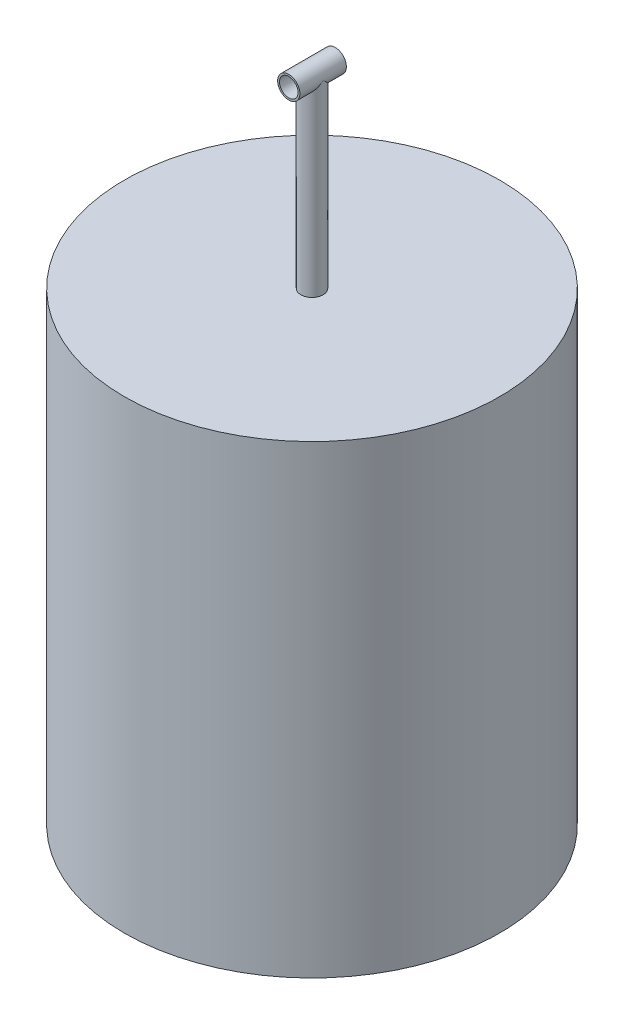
ISO-10303-21;
HEADER;
FILE_DESCRIPTION(('STEP AP214'),'2;1');
FILE_NAME('part.step','',(''),(''),'','','');
FILE_SCHEMA(('AUTOMOTIVE_DESIGN { 1 0 10303 214 1 1 1 1 }'));
ENDSEC;
DATA;
#1=APPLICATION_CONTEXT('core data for automotive mechanical design processes');
#2=APPLICATION_PROTOCOL_DEFINITION('international standard','automotive_design',2000,#1);
#3=PRODUCT_CONTEXT('',#1,'mechanical');
#4=PRODUCT('Part','Part','',(#3));
#5=PRODUCT_RELATED_PRODUCT_CATEGORY('part','',(#4));
#6=PRODUCT_DEFINITION_FORMATION('','',#4);
#7=PRODUCT_DEFINITION_CONTEXT('part definition',#1,'design');
#8=PRODUCT_DEFINITION('design','',#6,#7);
#9=PRODUCT_DEFINITION_SHAPE('','',#8);
#10=(LENGTH_UNIT() NAMED_UNIT(*) SI_UNIT(.MILLI.,.METRE.));
#11=(NAMED_UNIT(*) PLANE_ANGLE_UNIT() SI_UNIT($,.RADIAN.));
#12=(NAMED_UNIT(*) SI_UNIT($,.STERADIAN.) SOLID_ANGLE_UNIT());
#13=UNCERTAINTY_MEASURE_WITH_UNIT(LENGTH_MEASURE(1.E-05),#10,'distance_accuracy_value','');
#14=(GEOMETRIC_REPRESENTATION_CONTEXT(3) GLOBAL_UNCERTAINTY_ASSIGNED_CONTEXT((#13)) GLOBAL_UNIT_ASSIGNED_CONTEXT((#10,
#11,#12)) REPRESENTATION_CONTEXT('',''));
#15=CARTESIAN_POINT('',(0.,0.,0.));
#16=DIRECTION('',(0.,0.,1.));
#17=DIRECTION('',(1.,0.,0.));
#18=AXIS2_PLACEMENT_3D('',#15,#16,#17);
#19=CARTESIAN_POINT('',(0.,200.,25.));
#20=DIRECTION('',(0.,0.,1.));
#21=DIRECTION('',(1.,0.,0.));
#22=AXIS2_PLACEMENT_3D('',#19,#20,#21);
#23=PLANE('',#22);
#24=CARTESIAN_POINT('',(0.,200.,25.));
#25=DIRECTION('',(0.,0.,1.));
#26=DIRECTION('',(1.,0.,0.));
#27=AXIS2_PLACEMENT_3D('',#24,#25,#26);
#28=CIRCLE('',#27,12.);
#29=CARTESIAN_POINT('',(12.,200.,25.));
#30=VERTEX_POINT('',#29);
#31=EDGE_CURVE('E12',#30,#30,#28,.T.);
#32=ORIENTED_EDGE('',*,*,#31,.T.);
#33=EDGE_LOOP('',(#32));
#34=FACE_BOUND('',#33,.T.);
#35=CARTESIAN_POINT('',(0.,200.,25.));
#36=DIRECTION('',(0.,0.,1.));
#37=DIRECTION('',(1.,0.,0.));
#38=AXIS2_PLACEMENT_3D('',#35,#36,#37);
#39=CIRCLE('',#38,10.);
#40=CARTESIAN_POINT('',(10.,200.,25.));
#41=VERTEX_POINT('',#40);
#42=EDGE_CURVE('E60',#41,#41,#39,.T.);
#43=ORIENTED_EDGE('',*,*,#42,.F.);
#44=EDGE_LOOP('',(#43));
#45=FACE_BOUND('',#44,.T.);
#46=ADVANCED_FACE('F49',(#34,#45),#23,.T.);
#47=CARTESIAN_POINT('',(0.,200.,-25.));
#48=DIRECTION('',(0.,0.,1.));
#49=DIRECTION('',(1.,0.,0.));
#50=AXIS2_PLACEMENT_3D('',#47,#48,#49);
#51=PLANE('',#50);
#52=CARTESIAN_POINT('',(0.,200.,-25.));
#53=DIRECTION('',(0.,0.,1.));
#54=DIRECTION('',(1.,0.,0.));
#55=AXIS2_PLACEMENT_3D('',#52,#53,#54);
#56=CIRCLE('',#55,12.);
#57=CARTESIAN_POINT('',(12.,200.,-25.));
#58=VERTEX_POINT('',#57);
#59=EDGE_CURVE('E56',#58,#58,#56,.T.);
#60=ORIENTED_EDGE('',*,*,#59,.F.);
#61=EDGE_LOOP('',(#60));
#62=FACE_BOUND('',#61,.T.);
#63=CARTESIAN_POINT('',(0.,200.,-25.));
#64=DIRECTION('',(0.,0.,1.));
#65=DIRECTION('',(1.,0.,0.));
#66=AXIS2_PLACEMENT_3D('',#63,#64,#65);
#67=CIRCLE('',#66,10.);
#68=CARTESIAN_POINT('',(10.,200.,-25.));
#69=VERTEX_POINT('',#68);
#70=EDGE_CURVE('E64',#69,#69,#67,.T.);
#71=ORIENTED_EDGE('',*,*,#70,.T.);
#72=EDGE_LOOP('',(#71));
#73=FACE_BOUND('',#72,.T.);
#74=ADVANCED_FACE('F70',(#62,#73),#51,.F.);
#75=CARTESIAN_POINT('',(0.,200.,25.));
#76=DIRECTION('',(0.,0.,-1.));
#77=DIRECTION('',(-1.,0.,0.));
#78=AXIS2_PLACEMENT_3D('',#75,#76,#77);
#79=CYLINDRICAL_SURFACE('',#78,12.);
#80=ORIENTED_EDGE('',*,*,#31,.F.);
#81=EDGE_LOOP('',(#80));
#82=FACE_BOUND('',#81,.T.);
#83=ORIENTED_EDGE('',*,*,#59,.T.);
#84=EDGE_LOOP('',(#83));
#85=FACE_BOUND('',#84,.T.);
#86=ADVANCED_FACE('F51',(#82,#85),#79,.T.);
#87=CARTESIAN_POINT('',(0.,200.,25.));
#88=DIRECTION('',(0.,0.,-1.));
#89=DIRECTION('',(-1.,0.,0.));
#90=AXIS2_PLACEMENT_3D('',#87,#88,#89);
#91=CYLINDRICAL_SURFACE('',#90,10.);
#92=ORIENTED_EDGE('',*,*,#42,.T.);
#93=EDGE_LOOP('',(#92));
#94=FACE_BOUND('',#93,.T.);
#95=ORIENTED_EDGE('',*,*,#70,.F.);
#96=EDGE_LOOP('',(#95));
#97=FACE_BOUND('',#96,.T.);
#98=ADVANCED_FACE('F72',(#94,#97),#91,.F.);
#99=CLOSED_SHELL('',(#46,#74,#86,#98));
#100=MANIFOLD_SOLID_BREP('B2',#99);
#101=CARTESIAN_POINT('',(0.,0.,0.));
#102=DIRECTION('',(0.,1.,0.));
#103=DIRECTION('',(0.,0.,1.));
#104=AXIS2_PLACEMENT_3D('',#101,#102,#103);
#105=PLANE('',#104);
#106=CARTESIAN_POINT('',(0.,0.,0.));
#107=DIRECTION('',(0.,1.,0.));
#108=DIRECTION('',(0.,0.,1.));
#109=AXIS2_PLACEMENT_3D('',#106,#107,#108);
#110=CIRCLE('',#109,201.95);
#111=CARTESIAN_POINT('',(0.,0.,201.95));
#112=VERTEX_POINT('',#111);
#113=EDGE_CURVE('E125',#112,#112,#110,.T.);
#114=ORIENTED_EDGE('',*,*,#113,.T.);
#115=EDGE_LOOP('',(#114));
#116=FACE_BOUND('',#115,.T.);
#117=CARTESIAN_POINT('',(0.,0.,0.));
#118=DIRECTION('',(0.,1.,0.));
#119=DIRECTION('',(-1.,0.,0.));
#120=AXIS2_PLACEMENT_3D('',#117,#118,#119);
#121=CIRCLE('',#120,12.);
#122=CARTESIAN_POINT('',(-12.,0.,0.));
#123=VERTEX_POINT('',#122);
#124=EDGE_CURVE('E165',#123,#123,#121,.T.);
#125=ORIENTED_EDGE('',*,*,#124,.F.);
#126=EDGE_LOOP('',(#125));
#127=FACE_BOUND('',#126,.T.);
#128=ADVANCED_FACE('F103',(#116,#127),#105,.T.);
#129=CARTESIAN_POINT('',(0.,-500.,0.));
#130=DIRECTION('',(0.,1.,0.));
#131=DIRECTION('',(0.,0.,1.));
#132=AXIS2_PLACEMENT_3D('',#129,#130,#131);
#133=CYLINDRICAL_SURFACE('',#132,201.95);
#134=CARTESIAN_POINT('',(0.,-500.,0.));
#135=DIRECTION('',(0.,1.,0.));
#136=DIRECTION('',(0.,0.,1.));
#137=AXIS2_PLACEMENT_3D('',#134,#135,#136);
#138=CIRCLE('',#137,201.95);
#139=CARTESIAN_POINT('',(0.,-500.,201.95));
#140=VERTEX_POINT('',#139);
#141=EDGE_CURVE('E112',#140,#140,#138,.T.);
#142=ORIENTED_EDGE('',*,*,#141,.T.);
#143=EDGE_LOOP('',(#142));
#144=FACE_BOUND('',#143,.T.);
#145=ORIENTED_EDGE('',*,*,#113,.F.);
#146=EDGE_LOOP('',(#145));
#147=FACE_BOUND('',#146,.T.);
#148=ADVANCED_FACE('F105',(#144,#147),#133,.T.);
#149=CARTESIAN_POINT('',(0.,-500.,0.));
#150=DIRECTION('',(0.,1.,0.));
#151=DIRECTION('',(0.,0.,1.));
#152=AXIS2_PLACEMENT_3D('',#149,#150,#151);
#153=PLANE('',#152);
#154=ORIENTED_EDGE('',*,*,#141,.F.);
#155=EDGE_LOOP('',(#154));
#156=FACE_BOUND('',#155,.T.);
#157=ADVANCED_FACE('F135',(#156),#153,.F.);
#158=CARTESIAN_POINT('',(0.,212.001,0.));
#159=DIRECTION('',(0.,-1.,0.));
#160=DIRECTION('',(0.,0.,-1.));
#161=AXIS2_PLACEMENT_3D('',#158,#159,#160);
#162=CYLINDRICAL_SURFACE('',#161,12.);
#163=ORIENTED_EDGE('',*,*,#124,.T.);
#164=EDGE_LOOP('',(#163));
#165=FACE_BOUND('',#164,.T.);
#166=CARTESIAN_POINT('',(0.,200.,0.));
#167=DIRECTION('',(0.,-0.707106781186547,-0.707106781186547));
#168=DIRECTION('',(0.,-0.707106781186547,0.707106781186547));
#169=AXIS2_PLACEMENT_3D('',#166,#167,#168);
#170=ELLIPSE('',#169,16.9705627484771,12.);
#171=CARTESIAN_POINT('',(-12.,200.,0.));
#172=VERTEX_POINT('',#171);
#173=CARTESIAN_POINT('',(12.,200.,0.));
#174=VERTEX_POINT('',#173);
#175=EDGE_CURVE('E119',#172,#174,#170,.F.);
#176=ORIENTED_EDGE('',*,*,#175,.F.);
#177=CARTESIAN_POINT('',(0.,200.,0.));
#178=DIRECTION('',(0.,-0.707106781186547,0.707106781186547));
#179=DIRECTION('',(0.,-0.707106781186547,-0.707106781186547));
#180=AXIS2_PLACEMENT_3D('',#177,#178,#179);
#181=ELLIPSE('',#180,16.9705627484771,12.);
#182=EDGE_CURVE('E117',#174,#172,#181,.F.);
#183=ORIENTED_EDGE('',*,*,#182,.F.);
#184=EDGE_LOOP('',(#176,#183));
#185=FACE_BOUND('',#184,.T.);
#186=ADVANCED_FACE('F124',(#165,#185),#162,.T.);
#187=CARTESIAN_POINT('',(0.,212.001,0.));
#188=DIRECTION('',(0.,-1.,0.));
#189=DIRECTION('',(0.,0.,-1.));
#190=AXIS2_PLACEMENT_3D('',#187,#188,#189);
#191=CYLINDRICAL_SURFACE('',#190,10.);
#192=CARTESIAN_POINT('',(0.,0.,0.));
#193=DIRECTION('',(0.,1.,0.));
#194=DIRECTION('',(0.,0.,1.));
#195=AXIS2_PLACEMENT_3D('',#192,#193,#194);
#196=CIRCLE('',#195,10.);
#197=CARTESIAN_POINT('',(0.,0.,10.));
#198=VERTEX_POINT('',#197);
#199=EDGE_CURVE('E47',#198,#198,#196,.F.);
#200=ORIENTED_EDGE('',*,*,#199,.T.);
#201=EDGE_LOOP('',(#200));
#202=FACE_BOUND('',#201,.T.);
#203=CARTESIAN_POINT('',(0.,188.,-10.));
#204=CARTESIAN_POINT('',(-0.23753862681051,188.000001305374,-9.9999986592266));
#205=CARTESIAN_POINT('',(-0.475097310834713,188.007068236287,-9.9915214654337));
#206=CARTESIAN_POINT('',(-0.948194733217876,188.035172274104,-9.95777024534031));
#207=CARTESIAN_POINT('',(-1.18373323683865,188.056210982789,-9.93249429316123));
#208=CARTESIAN_POINT('',(-1.65099412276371,188.111786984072,-9.86559452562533));
#209=CARTESIAN_POINT('',(-1.88271416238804,188.146332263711,-9.82396103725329));
#210=CARTESIAN_POINT('',(-2.34047838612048,188.228159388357,-9.72507077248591));
#211=CARTESIAN_POINT('',(-2.56652260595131,188.275441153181,-9.66781409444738));
#212=CARTESIAN_POINT('',(-3.01014891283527,188.381449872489,-9.53897472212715));
#213=CARTESIAN_POINT('',(-3.22777399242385,188.440105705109,-9.46748098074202));
#214=CARTESIAN_POINT('',(-3.65486978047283,188.567956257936,-9.31094319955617));
#215=CARTESIAN_POINT('',(-3.86434064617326,188.637150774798,-9.22589942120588));
#216=CARTESIAN_POINT('',(-4.2743083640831,188.784930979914,-9.04326564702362));
#217=CARTESIAN_POINT('',(-4.47480440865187,188.863517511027,-8.94567452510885));
#218=CARTESIAN_POINT('',(-4.86623321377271,189.028904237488,-8.7389237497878));
#219=CARTESIAN_POINT('',(-5.05716393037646,189.115706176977,-8.62976163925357));
#220=CARTESIAN_POINT('',(-5.49737670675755,189.329539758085,-8.35870807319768));
#221=CARTESIAN_POINT('',(-5.74232938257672,189.459636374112,-8.19217728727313));
#222=CARTESIAN_POINT('',(-6.21303437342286,189.730047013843,-7.84120281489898));
#223=CARTESIAN_POINT('',(-6.43878014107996,189.870364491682,-7.65675306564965));
#224=CARTESIAN_POINT('',(-6.87137078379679,190.158659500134,-7.27106937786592));
#225=CARTESIAN_POINT('',(-7.07816664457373,190.306655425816,-7.06979435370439));
#226=CARTESIAN_POINT('',(-7.47215961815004,190.607014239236,-6.65201331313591));
#227=CARTESIAN_POINT('',(-7.65935919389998,190.759376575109,-6.43550921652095));
#228=CARTESIAN_POINT('',(-8.01745028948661,191.068181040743,-5.98373683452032));
#229=CARTESIAN_POINT('',(-8.18797839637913,191.224646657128,-5.74819660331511));
#230=CARTESIAN_POINT('',(-8.50862247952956,191.535181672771,-5.26195867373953));
#231=CARTESIAN_POINT('',(-8.65873162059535,191.689250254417,-5.01125594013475));
#232=CARTESIAN_POINT('',(-8.93764255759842,191.989977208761,-4.49493237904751));
#233=CARTESIAN_POINT('',(-9.06649454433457,192.13665245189,-4.22934873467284));
#234=CARTESIAN_POINT('',(-9.30214638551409,192.416890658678,-3.68222698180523));
#235=CARTESIAN_POINT('',(-9.4089650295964,192.550464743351,-3.40070273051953));
#236=CARTESIAN_POINT('',(-9.60774853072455,192.808332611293,-2.79327682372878));
#237=CARTESIAN_POINT('',(-9.69738421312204,192.930584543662,-2.46568859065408));
#238=CARTESIAN_POINT('',(-9.80744741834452,193.084943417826,-1.96051980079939));
#239=CARTESIAN_POINT('',(-9.84005650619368,193.131538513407,-1.78995044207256));
#240=CARTESIAN_POINT('',(-9.89663182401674,193.213311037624,-1.44472632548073));
#241=CARTESIAN_POINT('',(-9.9206026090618,193.248494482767,-1.27007377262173));
#242=CARTESIAN_POINT('',(-9.95963662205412,193.306205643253,-0.915353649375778));
#243=CARTESIAN_POINT('',(-9.97458198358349,193.328565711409,-0.735245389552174));
#244=CARTESIAN_POINT('',(-9.99467457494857,193.358703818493,-0.373263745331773));
#245=CARTESIAN_POINT('',(-9.99982272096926,193.366483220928,-0.191390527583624));
#246=CARTESIAN_POINT('',(-10.0001682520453,193.367004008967,0.172388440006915));
#247=CARTESIAN_POINT('',(-9.99536561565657,193.359745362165,0.354294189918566));
#248=CARTESIAN_POINT('',(-9.97595413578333,193.33061950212,0.716400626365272));
#249=CARTESIAN_POINT('',(-9.96134409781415,193.308750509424,0.896601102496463));
#250=CARTESIAN_POINT('',(-9.92111596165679,193.24923367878,1.26857859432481));
#251=CARTESIAN_POINT('',(-9.89468770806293,193.210430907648,1.46008115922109));
#252=CARTESIAN_POINT('',(-9.83147920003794,193.119223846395,1.83815157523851));
#253=CARTESIAN_POINT('',(-9.79469162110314,193.06680993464,2.02471583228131));
#254=CARTESIAN_POINT('',(-9.71139838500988,192.950613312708,2.39257439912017));
#255=CARTESIAN_POINT('',(-9.66486671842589,192.886800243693,2.57385309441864));
#256=CARTESIAN_POINT('',(-9.56282955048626,192.750202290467,2.93029953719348));
#257=CARTESIAN_POINT('',(-9.50732587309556,192.677419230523,3.10546851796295));
#258=CARTESIAN_POINT('',(-9.35269039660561,192.479973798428,3.55120790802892));
#259=CARTESIAN_POINT('',(-9.24711619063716,192.350003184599,3.81720421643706));
#260=CARTESIAN_POINT('',(-9.01616131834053,192.079104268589,4.33464800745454));
#261=CARTESIAN_POINT('',(-8.89076903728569,191.938169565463,4.58608683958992));
#262=CARTESIAN_POINT('',(-8.62086486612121,191.650167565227,5.07531461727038));
#263=CARTESIAN_POINT('',(-8.47632732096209,191.503092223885,5.31308462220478));
#264=CARTESIAN_POINT('',(-8.16870695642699,191.206944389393,5.77487433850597));
#265=CARTESIAN_POINT('',(-8.005627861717,191.057872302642,5.99889679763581));
#266=CARTESIAN_POINT('',(-7.65200807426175,190.753159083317,6.44452100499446));
#267=CARTESIAN_POINT('',(-7.46047687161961,190.597582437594,6.66538254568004));
#268=CARTESIAN_POINT('',(-7.05697567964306,190.291070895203,7.09120029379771));
#269=CARTESIAN_POINT('',(-6.84500265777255,190.140136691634,7.29615413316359));
#270=CARTESIAN_POINT('',(-6.40109128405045,189.846342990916,7.68853791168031));
#271=CARTESIAN_POINT('',(-6.16919124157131,189.703468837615,7.87600009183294));
#272=CARTESIAN_POINT('',(-5.68534760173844,189.428615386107,8.2320695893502));
#273=CARTESIAN_POINT('',(-5.43341082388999,189.296632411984,8.40068327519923));
#274=CARTESIAN_POINT('',(-4.97410770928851,189.077259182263,8.67822583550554));
#275=CARTESIAN_POINT('',(-4.77089748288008,188.986854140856,8.79166997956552));
#276=CARTESIAN_POINT('',(-4.35391530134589,188.815447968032,9.00545876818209));
#277=CARTESIAN_POINT('',(-4.14014585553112,188.734444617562,9.10580650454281));
#278=CARTESIAN_POINT('',(-3.70284910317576,188.583240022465,9.29222138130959));
#279=CARTESIAN_POINT('',(-3.47932510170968,188.513035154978,9.37829331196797));
#280=CARTESIAN_POINT('',(-3.02352450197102,188.384736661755,9.53500748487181));
#281=CARTESIAN_POINT('',(-2.79124776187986,188.326643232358,9.60564947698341));
#282=CARTESIAN_POINT('',(-2.31754327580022,188.223404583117,9.73085117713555));
#283=CARTESIAN_POINT('',(-2.0760584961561,188.178363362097,9.78528180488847));
#284=CARTESIAN_POINT('',(-1.5874837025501,188.10290019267,9.87631677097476));
#285=CARTESIAN_POINT('',(-1.34039367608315,188.07247827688,9.91292106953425));
#286=CARTESIAN_POINT('',(-0.842888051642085,188.027034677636,9.96755379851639));
#287=CARTESIAN_POINT('',(-0.592474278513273,188.012004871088,9.98559202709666));
#288=CARTESIAN_POINT('',(-0.0905626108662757,187.997716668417,10.0027410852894));
#289=CARTESIAN_POINT('',(0.160935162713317,187.998456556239,10.0018539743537));
#290=CARTESIAN_POINT('',(0.632480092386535,188.014643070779,9.98242462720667));
#291=CARTESIAN_POINT('',(0.852681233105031,188.028314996,9.96601286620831));
#292=CARTESIAN_POINT('',(1.29044638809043,188.067563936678,9.91883070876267));
#293=CARTESIAN_POINT('',(1.50801065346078,188.093139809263,9.88806169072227));
#294=CARTESIAN_POINT('',(1.93905109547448,188.155696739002,9.81264299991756));
#295=CARTESIAN_POINT('',(2.15252705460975,188.192678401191,9.76799259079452));
#296=CARTESIAN_POINT('',(2.57410035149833,188.277362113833,9.6654577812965));
#297=CARTESIAN_POINT('',(2.78219742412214,188.32506469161,9.60757272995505));
#298=CARTESIAN_POINT('',(3.19460527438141,188.431057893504,9.4784912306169));
#299=CARTESIAN_POINT('',(3.39883093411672,188.489478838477,9.40713058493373));
#300=CARTESIAN_POINT('',(3.79982955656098,188.6155591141,9.25243230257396));
#301=CARTESIAN_POINT('',(3.99659960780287,188.683222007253,9.1690900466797));
#302=CARTESIAN_POINT('',(4.38192662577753,188.826773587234,8.99131463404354));
#303=CARTESIAN_POINT('',(4.57048401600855,188.902661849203,8.89688205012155));
#304=CARTESIAN_POINT('',(4.93894261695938,189.061666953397,8.69774227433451));
#305=CARTESIAN_POINT('',(5.11884208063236,189.14478524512,8.5930330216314));
#306=CARTESIAN_POINT('',(5.54850518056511,189.356019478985,8.32489626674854));
#307=CARTESIAN_POINT('',(5.79333350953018,189.48757086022,8.15622778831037));
#308=CARTESIAN_POINT('',(6.26358298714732,189.760784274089,7.80092623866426));
#309=CARTESIAN_POINT('',(6.4889966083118,189.902450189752,7.61428625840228));
#310=CARTESIAN_POINT('',(6.92079147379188,190.19333960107,7.22409587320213));
#311=CARTESIAN_POINT('',(7.12711697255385,190.342583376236,7.02049904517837));
#312=CARTESIAN_POINT('',(7.51995907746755,190.645232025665,6.59798703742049));
#313=CARTESIAN_POINT('',(7.70647847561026,190.798636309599,6.37907402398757));
#314=CARTESIAN_POINT('',(8.06289381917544,191.109185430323,5.92242687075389));
#315=CARTESIAN_POINT('',(8.23243250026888,191.266348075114,5.68442600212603));
#316=CARTESIAN_POINT('',(8.5508770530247,191.577879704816,5.19309763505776));
#317=CARTESIAN_POINT('',(8.69977550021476,191.732247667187,4.93976466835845));
#318=CARTESIAN_POINT('',(8.97595200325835,192.032954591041,4.4180480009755));
#319=CARTESIAN_POINT('',(9.10328706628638,192.179314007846,4.14970656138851));
#320=CARTESIAN_POINT('',(9.33555315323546,192.458095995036,3.59685211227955));
#321=CARTESIAN_POINT('',(9.44050470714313,192.590531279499,3.31235422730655));
#322=CARTESIAN_POINT('',(9.63350154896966,192.842985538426,2.70286274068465));
#323=CARTESIAN_POINT('',(9.71956147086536,192.961202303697,2.376444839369));
#324=CARTESIAN_POINT('',(9.82441969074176,193.109103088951,1.87351856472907));
#325=CARTESIAN_POINT('',(9.85532071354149,193.153478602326,1.70378273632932));
#326=CARTESIAN_POINT('',(9.90855005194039,193.230743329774,1.36043207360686));
#327=CARTESIAN_POINT('',(9.93088283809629,193.263638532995,1.18681931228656));
#328=CARTESIAN_POINT('',(9.96670520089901,193.316749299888,0.834565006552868));
#329=CARTESIAN_POINT('',(9.98008461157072,193.336806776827,0.655888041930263));
#330=CARTESIAN_POINT('',(9.99720084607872,193.362514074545,0.297036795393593));
#331=CARTESIAN_POINT('',(10.0009384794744,193.368165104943,0.116862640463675));
#332=CARTESIAN_POINT('',(9.99866172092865,193.364733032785,-0.243321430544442));
#333=CARTESIAN_POINT('',(9.99264518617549,193.3556466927,-0.423331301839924));
#334=CARTESIAN_POINT('',(9.97103242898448,193.323258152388,-0.781482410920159));
#335=CARTESIAN_POINT('',(9.95543494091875,193.299954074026,-0.959623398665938));
#336=CARTESIAN_POINT('',(9.91292812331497,193.237202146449,-1.33133785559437));
#337=CARTESIAN_POINT('',(9.88499570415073,193.196305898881,-1.52454756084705));
#338=CARTESIAN_POINT('',(9.8186256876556,193.100873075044,-1.90580287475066));
#339=CARTESIAN_POINT('',(9.78018044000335,193.046326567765,-2.09384461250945));
#340=CARTESIAN_POINT('',(9.69343740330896,192.925907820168,-2.46446740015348));
#341=CARTESIAN_POINT('',(9.64511346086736,192.860005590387,-2.64703244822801));
#342=CARTESIAN_POINT('',(9.53936962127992,192.719328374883,-3.00589678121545));
#343=CARTESIAN_POINT('',(9.48195165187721,192.644555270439,-3.18219738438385));
#344=CARTESIAN_POINT('',(9.32207448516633,192.441960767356,-3.63105814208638));
#345=CARTESIAN_POINT('',(9.21305071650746,192.308904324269,-3.898930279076));
#346=CARTESIAN_POINT('',(8.9748084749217,192.032175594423,-4.41983033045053));
#347=CARTESIAN_POINT('',(8.84557826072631,191.888497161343,-4.67284949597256));
#348=CARTESIAN_POINT('',(8.56757527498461,191.595386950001,-5.1649390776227));
#349=CARTESIAN_POINT('',(8.41877647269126,191.445947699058,-5.40399029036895));
#350=CARTESIAN_POINT('',(8.10218582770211,191.14549679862,-5.86800175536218));
#351=CARTESIAN_POINT('',(7.93439781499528,190.99448547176,-6.09296483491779));
#352=CARTESIAN_POINT('',(7.57119559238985,190.686761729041,-6.53940481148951));
#353=CARTESIAN_POINT('',(7.3748288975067,190.530133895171,-6.76016694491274));
#354=CARTESIAN_POINT('',(6.96125121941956,190.2220920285,-7.18532719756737));
#355=CARTESIAN_POINT('',(6.74403696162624,190.070678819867,-7.38972273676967));
#356=CARTESIAN_POINT('',(6.28927481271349,189.776584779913,-7.78040529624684));
#357=CARTESIAN_POINT('',(6.05176639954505,189.633887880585,-7.96672603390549));
#358=CARTESIAN_POINT('',(5.55639020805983,189.360143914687,-8.31979293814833));
#359=CARTESIAN_POINT('',(5.29853026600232,189.229092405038,-8.48654657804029));
#360=CARTESIAN_POINT('',(4.83254020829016,189.01390369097,-8.75781002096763));
#361=CARTESIAN_POINT('',(4.6288209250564,188.926405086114,-8.86725688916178));
#362=CARTESIAN_POINT('',(4.21116688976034,188.760938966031,-9.07305011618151));
#363=CARTESIAN_POINT('',(3.99723450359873,188.682969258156,-9.16939948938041));
#364=CARTESIAN_POINT('',(3.56014859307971,188.537962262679,-9.34778066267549));
#365=CARTESIAN_POINT('',(3.33700431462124,188.470914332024,-9.4298264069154));
#366=CARTESIAN_POINT('',(2.8824248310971,188.348949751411,-9.57855861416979));
#367=CARTESIAN_POINT('',(2.65099078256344,188.294031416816,-9.6452472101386));
#368=CARTESIAN_POINT('',(2.22135699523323,188.205715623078,-9.75222485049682));
#369=CARTESIAN_POINT('',(2.02421705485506,188.170245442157,-9.79507623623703));
#370=CARTESIAN_POINT('',(1.62618296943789,188.108991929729,-9.86896657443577));
#371=CARTESIAN_POINT('',(1.42528790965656,188.083210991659,-9.90000260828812));
#372=CARTESIAN_POINT('',(1.02094606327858,188.041782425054,-9.94983213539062));
#373=CARTESIAN_POINT('',(0.817499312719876,188.02613465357,-9.96862580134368));
#374=CARTESIAN_POINT('',(0.409373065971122,188.005244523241,-9.99370833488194));
#375=CARTESIAN_POINT('',(0.20469398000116,187.999998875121,-10.0000011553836));
#376=CARTESIAN_POINT('',(0.,188.,-10.));
#377=B_SPLINE_CURVE_WITH_KNOTS('',3,(#203,#204,#205,#206,#207,#208,#209,#210,#211,#212,#213,
#214,#215,#216,#217,#218,#219,#220,#221,#222,#223,#224,#225,#226,#227,#228,#229,#230,#231,#232,
#233,#234,#235,#236,#237,#238,#239,#240,#241,#242,#243,#244,#245,#246,#247,#248,#249,#250,#251,
#252,#253,#254,#255,#256,#257,#258,#259,#260,#261,#262,#263,#264,#265,#266,#267,#268,#269,#270,
#271,#272,#273,#274,#275,#276,#277,#278,#279,#280,#281,#282,#283,#284,#285,#286,#287,#288,#289,
#290,#291,#292,#293,#294,#295,#296,#297,#298,#299,#300,#301,#302,#303,#304,#305,#306,#307,#308,
#309,#310,#311,#312,#313,#314,#315,#316,#317,#318,#319,#320,#321,#322,#323,#324,#325,#326,#327,
#328,#329,#330,#331,#332,#333,#334,#335,#336,#337,#338,#339,#340,#341,#342,#343,#344,#345,#346,
#347,#348,#349,#350,#351,#352,#353,#354,#355,#356,#357,#358,#359,#360,#361,#362,#363,#364,#365,
#366,#367,#368,#369,#370,#371,#372,#373,#374,#375,#376),.UNSPECIFIED.,.T.,.F.,(4,2,2,2,2,2,2,2,
2,2,2,2,2,2,2,2,2,2,2,2,2,2,2,2,2,2,2,2,2,2,2,2,2,2,2,2,2,2,2,2,2,2,2,2,2,2,2,2,2,2,2,2,2,2,2,2,
2,2,2,2,2,2,2,2,2,2,2,2,2,2,2,2,2,2,2,2,2,2,2,2,2,2,2,2,2,2,4),(0.,0.712397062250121,
1.4248758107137,2.13777651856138,2.85067273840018,3.55924716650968,4.26780792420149,
4.97643231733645,5.68520749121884,6.65434611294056,7.62381378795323,8.59572212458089,
9.56750816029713,10.5571736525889,11.5471696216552,12.5347935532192,13.5215717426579,
14.6007980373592,15.1396950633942,15.6783075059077,16.2238097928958,16.7692610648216,
17.3147135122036,17.8602324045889,18.4508473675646,19.0418809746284,19.6345127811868,
20.227024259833,21.168502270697,22.1105341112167,23.053841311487,23.9969593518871,
24.9894330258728,25.982054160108,26.9728079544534,27.9632259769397,28.711578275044,
29.4597535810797,30.2076773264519,30.9556131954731,31.7093542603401,32.4630970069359,
33.2164417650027,33.9697045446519,34.6326143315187,35.2954604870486,35.9583418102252,
36.621255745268,37.2928399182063,37.9646837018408,38.6364927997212,39.3084368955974,
40.2823505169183,41.2566400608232,42.2336906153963,43.2106032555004,44.2050001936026,
45.1997539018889,46.1918352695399,47.1830027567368,48.2523175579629,48.7862317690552,
49.3198670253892,49.8599532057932,50.399994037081,50.9401535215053,51.4803843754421,
52.077831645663,52.6757148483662,53.2752019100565,53.8745620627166,54.8281385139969,
55.7822711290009,56.7376860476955,57.6929086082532,58.6950792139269,59.6974074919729,
60.6978285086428,61.6978661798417,62.4389733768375,63.1799097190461,63.9201196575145,
64.6602267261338,65.2741714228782,65.8882676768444,66.5023552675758,67.1162486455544),.UNSPECIFIED.);
#378=CARTESIAN_POINT('',(0.,188.,-10.));
#379=VERTEX_POINT('',#378);
#380=EDGE_CURVE('E122',#379,#379,#377,.T.);
#381=ORIENTED_EDGE('',*,*,#380,.T.);
#382=EDGE_LOOP('',(#381));
#383=FACE_BOUND('',#382,.T.);
#384=ADVANCED_FACE('F142',(#202,#383),#191,.F.);
#385=CARTESIAN_POINT('',(0.,200.,25.));
#386=DIRECTION('',(0.,0.,-1.));
#387=DIRECTION('',(-1.,0.,0.));
#388=AXIS2_PLACEMENT_3D('',#385,#386,#387);
#389=CYLINDRICAL_SURFACE('',#388,12.);
#390=ORIENTED_EDGE('',*,*,#380,.F.);
#391=EDGE_LOOP('',(#390));
#392=FACE_BOUND('',#391,.T.);
#393=ORIENTED_EDGE('',*,*,#175,.T.);
#394=ORIENTED_EDGE('',*,*,#182,.T.);
#395=EDGE_LOOP('',(#393,#394));
#396=FACE_BOUND('',#395,.T.);
#397=ADVANCED_FACE('F120',(#392,#396),#389,.F.);
#398=ORIENTED_EDGE('',*,*,#199,.F.);
#399=EDGE_LOOP('',(#398));
#400=FACE_BOUND('',#399,.T.);
#401=ADVANCED_FACE('F147',(#400),#105,.T.);
#402=CLOSED_SHELL('',(#128,#148,#157,#186,#384,#397,#401));
#403=MANIFOLD_SOLID_BREP('B7',#402);
#404=ADVANCED_BREP_SHAPE_REPRESENTATION('',(#18,#100,#403),#14);
#405=SHAPE_DEFINITION_REPRESENTATION(#9,#404);
ENDSEC;
END-ISO-10303-21;
